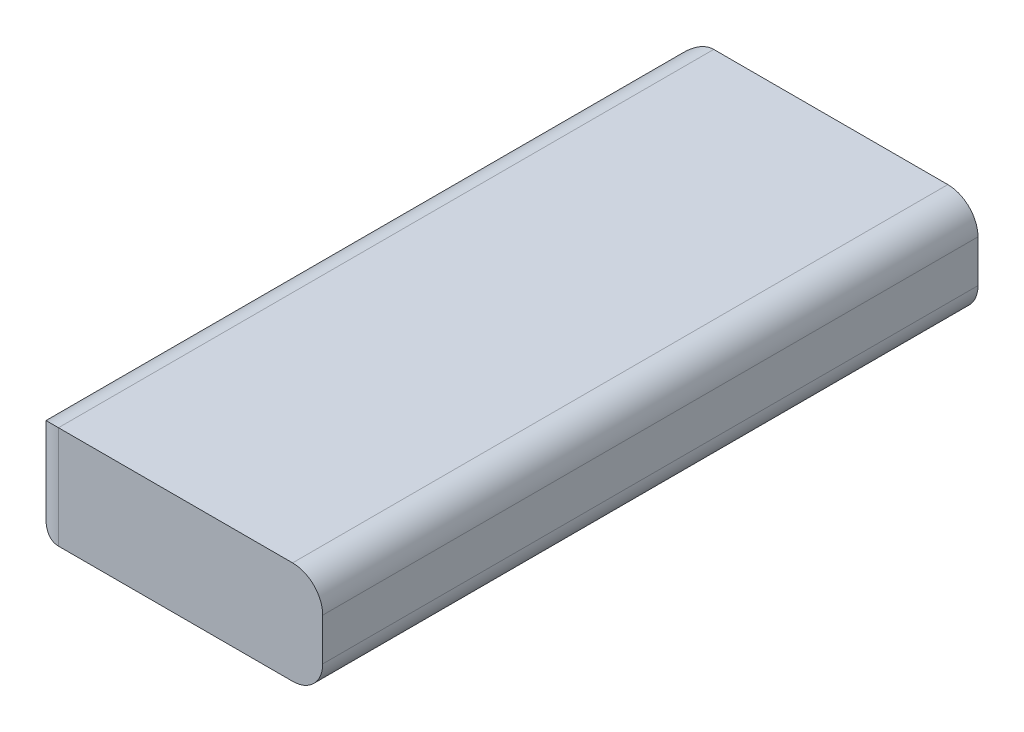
from build123d import *

# Parameters (mm, degrees)
BOSS_EXTRUDE1_DEPTH = 137.922
CUT_EXTRUDE1_DEPTH  = 153.740403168


with BuildPart() as part:
    # Sketch1 → Boss-Extrude1 (new body)
    with BuildSketch(Plane.XY):
        with BuildLine():
            Line((6.35, 0), (55.626, 0))
            ThreePointArc((55.626, 0), (60.116128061, 1.859871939), (61.976, 6.35))
            Line((61.976, 6.35), (61.976, 15.24))
            ThreePointArc((61.976, 15.24), (60.116128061, 19.730128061), (55.626, 21.59))
            Line((55.626, 21.59), (6.35, 21.59))
            ThreePointArc((6.35, 21.59), (1.859871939, 19.730128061), (0, 15.24))
            Line((0, 15.24), (0, 6.35))
            ThreePointArc((0, 6.35), (1.859871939, 1.859871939), (6.35, 0))
        make_face()
    extrude(amount=BOSS_EXTRUDE1_DEPTH)

    # Sketch2 → Cut-Extrude1 (cut, through all)
    with BuildSketch(Plane(origin=(0, 21.59, 0), x_dir=(1, 0, 0), z_dir=(0, 1, 0))):
        with BuildLine():
            Line((0, -137.922), (0, -131.572))
            ThreePointArc((0, -131.572), (1.859871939, -136.062128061), (6.35, -137.922))
            Line((6.35, -137.922), (0, -137.922))
        make_face()
        with BuildLine():
            Line((0, 0), (-0.016444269, -6.349978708))
            ThreePointArc((-0.016444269, -6.349978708), (1.854061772, -1.858869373), (6.35, 0))
            Line((6.35, 0), (0, 0))
        make_face()
    extrude(amount=-CUT_EXTRUDE1_DEPTH, mode=Mode.SUBTRACT)


solid = part.part
